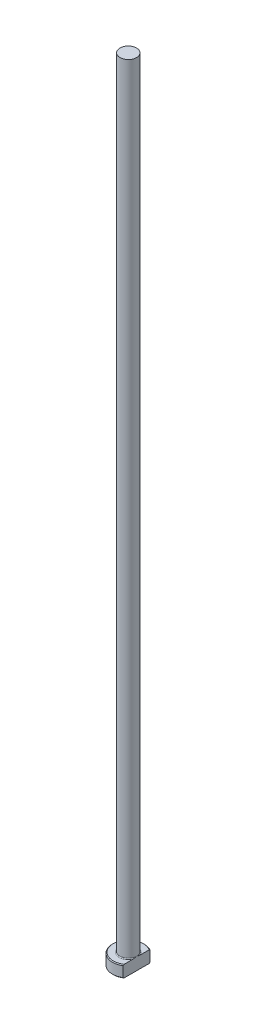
ISO-10303-21;
HEADER;
FILE_DESCRIPTION(('STEP AP214'),'2;1');
FILE_NAME('part.step','',(''),(''),'','','');
FILE_SCHEMA(('AUTOMOTIVE_DESIGN { 1 0 10303 214 1 1 1 1 }'));
ENDSEC;
DATA;
#1=APPLICATION_CONTEXT('core data for automotive mechanical design processes');
#2=APPLICATION_PROTOCOL_DEFINITION('international standard','automotive_design',2000,#1);
#3=PRODUCT_CONTEXT('',#1,'mechanical');
#4=PRODUCT('Part','Part','',(#3));
#5=PRODUCT_RELATED_PRODUCT_CATEGORY('part','',(#4));
#6=PRODUCT_DEFINITION_FORMATION('','',#4);
#7=PRODUCT_DEFINITION_CONTEXT('part definition',#1,'design');
#8=PRODUCT_DEFINITION('design','',#6,#7);
#9=PRODUCT_DEFINITION_SHAPE('','',#8);
#10=(LENGTH_UNIT() NAMED_UNIT(*) SI_UNIT(.MILLI.,.METRE.));
#11=(NAMED_UNIT(*) PLANE_ANGLE_UNIT() SI_UNIT($,.RADIAN.));
#12=(NAMED_UNIT(*) SI_UNIT($,.STERADIAN.) SOLID_ANGLE_UNIT());
#13=UNCERTAINTY_MEASURE_WITH_UNIT(LENGTH_MEASURE(1.E-05),#10,'distance_accuracy_value','');
#14=(GEOMETRIC_REPRESENTATION_CONTEXT(3) GLOBAL_UNCERTAINTY_ASSIGNED_CONTEXT((#13)) GLOBAL_UNIT_ASSIGNED_CONTEXT((#10,
#11,#12)) REPRESENTATION_CONTEXT('',''));
#15=CARTESIAN_POINT('',(0.,0.,0.));
#16=DIRECTION('',(0.,0.,1.));
#17=DIRECTION('',(1.,0.,0.));
#18=AXIS2_PLACEMENT_3D('',#15,#16,#17);
#19=CARTESIAN_POINT('',(0.,0.,0.));
#20=DIRECTION('',(0.,-1.,0.));
#21=DIRECTION('',(0.,0.,-1.));
#22=AXIS2_PLACEMENT_3D('',#19,#20,#21);
#23=PLANE('',#22);
#24=CARTESIAN_POINT('',(0.,0.,0.));
#25=DIRECTION('',(0.,-1.,0.));
#26=DIRECTION('',(0.,0.,-1.));
#27=AXIS2_PLACEMENT_3D('',#24,#25,#26);
#28=CIRCLE('',#27,3.79999999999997);
#29=CARTESIAN_POINT('',(2.09999999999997,0.,3.16701752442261));
#30=VERTEX_POINT('',#29);
#31=CARTESIAN_POINT('',(2.09999999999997,0.,-3.16701752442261));
#32=VERTEX_POINT('',#31);
#33=EDGE_CURVE('E98',#30,#32,#28,.T.);
#34=ORIENTED_EDGE('',*,*,#33,.T.);
#35=DIRECTION('',(0.,0.,1.));
#36=VECTOR('',#35,1.);
#37=CARTESIAN_POINT('',(2.09999999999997,0.,-3.40440890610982));
#38=LINE('',#37,#36);
#39=EDGE_CURVE('E83',#32,#30,#38,.T.);
#40=ORIENTED_EDGE('',*,*,#39,.T.);
#41=EDGE_LOOP('',(#34,#40));
#42=FACE_BOUND('',#41,.T.);
#43=ADVANCED_FACE('F32',(#42),#23,.T.);
#44=CARTESIAN_POINT('',(0.,259.958771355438,0.));
#45=DIRECTION('',(0.,1.,0.));
#46=DIRECTION('',(0.,0.,1.));
#47=AXIS2_PLACEMENT_3D('',#44,#45,#46);
#48=CYLINDRICAL_SURFACE('',#47,3.99999999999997);
#49=CARTESIAN_POINT('',(0.,2.80000000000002,0.));
#50=DIRECTION('',(0.,1.,0.));
#51=DIRECTION('',(0.,0.,1.));
#52=AXIS2_PLACEMENT_3D('',#49,#50,#51);
#53=CIRCLE('',#52,3.99999999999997);
#54=CARTESIAN_POINT('',(2.09999999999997,2.80000000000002,3.40440890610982));
#55=VERTEX_POINT('',#54);
#56=CARTESIAN_POINT('',(2.09999999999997,2.80000000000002,-3.40440890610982));
#57=VERTEX_POINT('',#56);
#58=EDGE_CURVE('E104',#55,#57,#53,.F.);
#59=ORIENTED_EDGE('',*,*,#58,.T.);
#60=DIRECTION('',(0.,-1.,0.));
#61=VECTOR('',#60,1.);
#62=CARTESIAN_POINT('',(2.09999999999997,200.,-3.40440890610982));
#63=LINE('',#62,#61);
#64=CARTESIAN_POINT('',(2.09999999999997,0.199999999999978,-3.40440890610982));
#65=VERTEX_POINT('',#64);
#66=EDGE_CURVE('E183',#57,#65,#63,.T.);
#67=ORIENTED_EDGE('',*,*,#66,.T.);
#68=CARTESIAN_POINT('',(0.,0.199999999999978,0.));
#69=DIRECTION('',(0.,-1.,0.));
#70=DIRECTION('',(0.,0.,-1.));
#71=AXIS2_PLACEMENT_3D('',#68,#69,#70);
#72=CIRCLE('',#71,3.99999999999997);
#73=CARTESIAN_POINT('',(2.09999999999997,0.199999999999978,3.40440890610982));
#74=VERTEX_POINT('',#73);
#75=EDGE_CURVE('E100',#65,#74,#72,.F.);
#76=ORIENTED_EDGE('',*,*,#75,.T.);
#77=DIRECTION('',(0.,-1.,0.));
#78=VECTOR('',#77,1.);
#79=CARTESIAN_POINT('',(2.09999999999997,200.,3.40440890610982));
#80=LINE('',#79,#78);
#81=EDGE_CURVE('E93',#55,#74,#80,.T.);
#82=ORIENTED_EDGE('',*,*,#81,.F.);
#83=EDGE_LOOP('',(#59,#67,#76,#82));
#84=FACE_BOUND('',#83,.T.);
#85=ADVANCED_FACE('F158',(#84),#48,.T.);
#86=CARTESIAN_POINT('',(-3.99999999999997,3.,0.));
#87=DIRECTION('',(0.,1.,0.));
#88=DIRECTION('',(0.,0.,1.));
#89=AXIS2_PLACEMENT_3D('',#86,#87,#88);
#90=PLANE('',#89);
#91=CARTESIAN_POINT('',(0.,3.,0.));
#92=DIRECTION('',(0.,1.,0.));
#93=DIRECTION('',(0.,0.,1.));
#94=AXIS2_PLACEMENT_3D('',#91,#92,#93);
#95=CIRCLE('',#94,3.80000000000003);
#96=CARTESIAN_POINT('',(2.09999999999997,3.,-3.16701752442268));
#97=VERTEX_POINT('',#96);
#98=CARTESIAN_POINT('',(2.09999999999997,3.,3.16701752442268));
#99=VERTEX_POINT('',#98);
#100=EDGE_CURVE('E178',#97,#99,#95,.T.);
#101=ORIENTED_EDGE('',*,*,#100,.T.);
#102=DIRECTION('',(0.,0.,-1.));
#103=VECTOR('',#102,1.);
#104=CARTESIAN_POINT('',(2.09999999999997,3.,0.));
#105=LINE('',#104,#103);
#106=CARTESIAN_POINT('',(2.09999999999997,2.99999999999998,0.938083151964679));
#107=VERTEX_POINT('',#106);
#108=EDGE_CURVE('E57',#99,#107,#105,.T.);
#109=ORIENTED_EDGE('',*,*,#108,.T.);
#110=CARTESIAN_POINT('',(0.,3.,0.));
#111=DIRECTION('',(0.,1.,0.));
#112=DIRECTION('',(0.,0.,1.));
#113=AXIS2_PLACEMENT_3D('',#110,#111,#112);
#114=CIRCLE('',#113,2.29999999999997);
#115=CARTESIAN_POINT('',(2.09999999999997,2.99999999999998,-0.938083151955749));
#116=VERTEX_POINT('',#115);
#117=EDGE_CURVE('E107',#107,#116,#114,.F.);
#118=ORIENTED_EDGE('',*,*,#117,.T.);
#119=EDGE_CURVE('E136',#116,#97,#105,.T.);
#120=ORIENTED_EDGE('',*,*,#119,.T.);
#121=EDGE_LOOP('',(#101,#109,#118,#120));
#122=FACE_BOUND('',#121,.T.);
#123=ADVANCED_FACE('F147',(#122),#90,.T.);
#124=CARTESIAN_POINT('',(0.,3.,0.));
#125=DIRECTION('',(0.,-1.,0.));
#126=DIRECTION('',(0.,0.,-1.));
#127=AXIS2_PLACEMENT_3D('',#124,#125,#126);
#128=CONICAL_SURFACE('',#127,3.80000000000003,0.785398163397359);
#129=ORIENTED_EDGE('',*,*,#58,.F.);
#130=CARTESIAN_POINT('',(2.09999999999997,-0.980423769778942,7.49166163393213));
#131=CARTESIAN_POINT('',(2.09999999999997,-0.83147426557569,7.33696373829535));
#132=CARTESIAN_POINT('',(2.09999999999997,-0.682692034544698,7.18210431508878));
#133=CARTESIAN_POINT('',(2.09999999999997,-0.385548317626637,6.8719796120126));
#134=CARTESIAN_POINT('',(2.09999999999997,-0.237186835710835,6.71671432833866));
#135=CARTESIAN_POINT('',(2.09999999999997,0.0590779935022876,6.40564381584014));
#136=CARTESIAN_POINT('',(2.09999999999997,0.206981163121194,6.24983841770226));
#137=CARTESIAN_POINT('',(2.09999999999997,0.502154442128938,5.9376299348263));
#138=CARTESIAN_POINT('',(2.09999999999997,0.649424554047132,5.78122685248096));
#139=CARTESIAN_POINT('',(2.09999999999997,0.94077633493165,5.47022973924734));
#140=CARTESIAN_POINT('',(2.09999999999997,1.08487085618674,5.31564775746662));
#141=CARTESIAN_POINT('',(2.09999999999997,1.372076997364,5.00557364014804));
#142=CARTESIAN_POINT('',(2.09999999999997,1.51518862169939,4.85008150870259));
#143=CARTESIAN_POINT('',(2.09999999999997,1.80010839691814,4.53794892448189));
#144=CARTESIAN_POINT('',(2.09999999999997,1.9419167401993,4.38130864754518));
#145=CARTESIAN_POINT('',(2.09999999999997,2.22381768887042,4.06649383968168));
#146=CARTESIAN_POINT('',(2.09999999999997,2.36391033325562,3.90831934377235));
#147=CARTESIAN_POINT('',(2.09999999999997,2.60581733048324,3.63104485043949));
#148=CARTESIAN_POINT('',(2.09999999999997,2.70816653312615,3.51241214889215));
#149=CARTESIAN_POINT('',(2.09999999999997,2.9111669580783,3.27367935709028));
#150=CARTESIAN_POINT('',(2.09999999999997,3.01181801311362,3.15357912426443));
#151=CARTESIAN_POINT('',(2.09999999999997,3.21179811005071,2.9103337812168));
#152=CARTESIAN_POINT('',(2.09999999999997,3.31110514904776,2.78717050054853));
#153=CARTESIAN_POINT('',(2.09999999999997,3.50648239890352,2.53834531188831));
#154=CARTESIAN_POINT('',(2.09999999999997,3.60255343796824,2.41268405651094));
#155=CARTESIAN_POINT('',(2.09999999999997,3.79142541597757,2.15619995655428));
#156=CARTESIAN_POINT('',(2.09999999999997,3.88416307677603,2.0253298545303));
#157=CARTESIAN_POINT('',(2.09999999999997,4.01801013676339,1.82534891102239));
#158=CARTESIAN_POINT('',(2.09999999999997,4.06178099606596,1.75802258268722));
#159=CARTESIAN_POINT('',(2.09999999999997,4.14708263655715,1.62197021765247));
#160=CARTESIAN_POINT('',(2.09999999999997,4.18861364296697,1.55324432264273));
#161=CARTESIAN_POINT('',(2.09999999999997,4.26843053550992,1.41491925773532));
#162=CARTESIAN_POINT('',(2.09999999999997,4.30674712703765,1.34533804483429));
#163=CARTESIAN_POINT('',(2.09999999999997,4.3798981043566,1.20437862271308));
#164=CARTESIAN_POINT('',(2.09999999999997,4.41473181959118,1.13300007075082));
#165=CARTESIAN_POINT('',(2.09999999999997,4.51246602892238,0.916193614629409));
#166=CARTESIAN_POINT('',(2.09999999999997,4.56890635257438,0.767589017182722));
#167=CARTESIAN_POINT('',(2.09999999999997,4.63146309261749,0.545044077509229));
#168=CARTESIAN_POINT('',(2.09999999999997,4.64829911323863,0.474096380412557));
#169=CARTESIAN_POINT('',(2.09999999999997,4.67524959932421,0.330910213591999));
#170=CARTESIAN_POINT('',(2.09999999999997,4.685364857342,0.258671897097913));
#171=CARTESIAN_POINT('',(2.09999999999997,4.69814808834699,0.113837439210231));
#172=CARTESIAN_POINT('',(2.09999999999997,4.70084750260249,0.0412441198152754));
#173=CARTESIAN_POINT('',(2.09999999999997,4.69868618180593,-0.103832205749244));
#174=CARTESIAN_POINT('',(2.09999999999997,4.69382503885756,-0.176315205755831));
#175=CARTESIAN_POINT('',(2.09999999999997,4.67696192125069,-0.319913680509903));
#176=CARTESIAN_POINT('',(2.09999999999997,4.66501009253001,-0.391035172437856));
#177=CARTESIAN_POINT('',(2.09999999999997,4.63477414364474,-0.531925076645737));
#178=CARTESIAN_POINT('',(2.09999999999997,4.61648741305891,-0.601692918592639));
#179=CARTESIAN_POINT('',(2.09999999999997,4.57440952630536,-0.740018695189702));
#180=CARTESIAN_POINT('',(2.09999999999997,4.5505834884,-0.808565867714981));
#181=CARTESIAN_POINT('',(2.09999999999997,4.49846635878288,-0.94390305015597));
#182=CARTESIAN_POINT('',(2.09999999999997,4.47017609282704,-1.01069338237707));
#183=CARTESIAN_POINT('',(2.09999999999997,4.38350646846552,-1.20069593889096));
#184=CARTESIAN_POINT('',(2.09999999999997,4.32056256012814,-1.32181878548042));
#185=CARTESIAN_POINT('',(2.09999999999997,4.1862118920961,-1.55931752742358));
#186=CARTESIAN_POINT('',(2.09999999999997,4.1147953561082,-1.67568772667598));
#187=CARTESIAN_POINT('',(2.09999999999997,3.96595132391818,-1.90511626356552));
#188=CARTESIAN_POINT('',(2.09999999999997,3.88850194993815,-2.01816028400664));
#189=CARTESIAN_POINT('',(2.09999999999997,3.72960863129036,-2.24129989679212));
#190=CARTESIAN_POINT('',(2.09999999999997,3.64816653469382,-2.3513968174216));
#191=CARTESIAN_POINT('',(2.09999999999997,3.48133411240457,-2.57073305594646));
#192=CARTESIAN_POINT('',(2.09999999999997,3.39590709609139,-2.67994433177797));
#193=CARTESIAN_POINT('',(2.09999999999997,3.2228375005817,-2.89660720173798));
#194=CARTESIAN_POINT('',(2.09999999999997,3.1351947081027,-3.00405862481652));
#195=CARTESIAN_POINT('',(2.09999999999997,2.95843815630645,-3.21731964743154));
#196=CARTESIAN_POINT('',(2.09999999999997,2.86932829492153,-3.32313248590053));
#197=CARTESIAN_POINT('',(2.09999999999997,2.68980874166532,-3.53365081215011));
#198=CARTESIAN_POINT('',(2.09999999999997,2.59939902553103,-3.6383562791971));
#199=CARTESIAN_POINT('',(2.09999999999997,2.36547490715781,-3.90659393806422));
#200=CARTESIAN_POINT('',(2.09999999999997,2.2212060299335,-4.06946765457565));
#201=CARTESIAN_POINT('',(2.09999999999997,1.93085962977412,-4.39359699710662));
#202=CARTESIAN_POINT('',(2.09999999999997,1.78478206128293,-4.55485258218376));
#203=CARTESIAN_POINT('',(2.09999999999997,1.49115582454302,-4.87627982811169));
#204=CARTESIAN_POINT('',(2.09999999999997,1.3436059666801,-5.03645040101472));
#205=CARTESIAN_POINT('',(2.09999999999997,1.04748117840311,-5.35584132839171));
#206=CARTESIAN_POINT('',(2.09999999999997,0.898906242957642,-5.51506167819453));
#207=CARTESIAN_POINT('',(2.09999999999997,0.463656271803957,-5.9791777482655));
#208=CARTESIAN_POINT('',(2.09999999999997,0.175917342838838,-6.28307552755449));
#209=CARTESIAN_POINT('',(2.09999999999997,-0.256953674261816,-6.73740739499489));
#210=CARTESIAN_POINT('',(2.09999999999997,-0.40137728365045,-6.888518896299));
#211=CARTESIAN_POINT('',(2.09999999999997,-0.690621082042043,-7.1903594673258));
#212=CARTESIAN_POINT('',(2.09999999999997,-0.835441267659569,-7.34108854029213));
#213=CARTESIAN_POINT('',(2.09999999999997,-0.980423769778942,-7.49166163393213));
#214=B_SPLINE_CURVE_WITH_KNOTS('',3,(#130,#131,#132,#133,#134,#135,#136,#137,#138,#139,#140,
#141,#142,#143,#144,#145,#146,#147,#148,#149,#150,#151,#152,#153,#154,#155,#156,#157,#158,#159,
#160,#161,#162,#163,#164,#165,#166,#167,#168,#169,#170,#171,#172,#173,#174,#175,#176,#177,#178,
#179,#180,#181,#182,#183,#184,#185,#186,#187,#188,#189,#190,#191,#192,#193,#194,#195,#196,#197,
#198,#199,#200,#201,#202,#203,#204,#205,#206,#207,#208,#209,#210,#211,#212,#213),.UNSPECIFIED.,
.F.,.F.,(4,2,2,2,2,2,2,2,2,2,2,2,2,2,2,2,2,2,2,2,2,2,2,2,2,2,2,2,2,2,2,2,2,2,2,2,2,2,2,2,2,4),
(0.,0.644249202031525,1.28850446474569,1.93298425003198,2.57746145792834,3.21143723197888,
3.84541015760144,4.47928793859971,5.1131512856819,5.58318355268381,6.05326185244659,
6.52785804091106,7.00233182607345,7.48334172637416,7.72421875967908,7.96507152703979,
8.20327136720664,8.44151697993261,8.91624038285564,9.13473354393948,9.35320093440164,
9.57074063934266,9.78829208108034,10.0043230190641,10.2204430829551,10.4379628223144,
10.6554423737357,11.0643686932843,11.4737715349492,11.8847351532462,12.2955103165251,
12.7114337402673,13.1273973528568,13.5423929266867,13.9573962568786,14.6101174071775,
15.2628550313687,15.9161714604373,16.5694910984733,17.8249945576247,18.4520794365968,
19.0791589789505),.UNSPECIFIED.);
#215=EDGE_CURVE('E135',#55,#99,#214,.T.);
#216=ORIENTED_EDGE('',*,*,#215,.T.);
#217=ORIENTED_EDGE('',*,*,#100,.F.);
#218=EDGE_CURVE('E127',#97,#57,#214,.T.);
#219=ORIENTED_EDGE('',*,*,#218,.T.);
#220=EDGE_LOOP('',(#129,#216,#217,#219));
#221=FACE_BOUND('',#220,.T.);
#222=ADVANCED_FACE('F143',(#221),#128,.T.);
#223=CARTESIAN_POINT('',(0.,0.199999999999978,0.));
#224=DIRECTION('',(0.,1.,0.));
#225=DIRECTION('',(0.,0.,1.));
#226=AXIS2_PLACEMENT_3D('',#223,#224,#225);
#227=CONICAL_SURFACE('',#226,3.99999999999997,0.785398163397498);
#228=ORIENTED_EDGE('',*,*,#75,.F.);
#229=CARTESIAN_POINT('',(2.09999999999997,3.98042376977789,-7.49166163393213));
#230=CARTESIAN_POINT('',(2.09999999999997,3.8314742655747,-7.33696373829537));
#231=CARTESIAN_POINT('',(2.09999999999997,3.68269203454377,-7.18210431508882));
#232=CARTESIAN_POINT('',(2.09999999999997,3.38554831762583,-6.87197961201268));
#233=CARTESIAN_POINT('',(2.09999999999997,3.23718683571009,-6.71671432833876));
#234=CARTESIAN_POINT('',(2.09999999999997,2.94092200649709,-6.40564381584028));
#235=CARTESIAN_POINT('',(2.09999999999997,2.79301883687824,-6.24983841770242));
#236=CARTESIAN_POINT('',(2.09999999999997,2.49784555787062,-5.9376299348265));
#237=CARTESIAN_POINT('',(2.09999999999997,2.35057544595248,-5.78122685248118));
#238=CARTESIAN_POINT('',(2.09999999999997,2.05922366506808,-5.4702297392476));
#239=CARTESIAN_POINT('',(2.09999999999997,1.91512914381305,-5.3156477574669));
#240=CARTESIAN_POINT('',(2.09999999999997,1.6279230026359,-5.00557364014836));
#241=CARTESIAN_POINT('',(2.09999999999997,1.48481137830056,-4.85008150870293));
#242=CARTESIAN_POINT('',(2.09999999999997,1.19989160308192,-4.53794892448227));
#243=CARTESIAN_POINT('',(2.09999999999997,1.05808325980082,-4.38130864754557));
#244=CARTESIAN_POINT('',(2.09999999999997,0.776182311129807,-4.06649383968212));
#245=CARTESIAN_POINT('',(2.09999999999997,0.636089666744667,-3.9083193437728));
#246=CARTESIAN_POINT('',(2.09999999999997,0.394182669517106,-3.63104485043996));
#247=CARTESIAN_POINT('',(2.09999999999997,0.291833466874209,-3.51241214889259));
#248=CARTESIAN_POINT('',(2.09999999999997,0.0888330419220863,-3.2736793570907));
#249=CARTESIAN_POINT('',(2.09999999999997,-0.0118180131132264,-3.15357912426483));
#250=CARTESIAN_POINT('',(2.09999999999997,-0.211798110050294,-2.91033378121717));
#251=CARTESIAN_POINT('',(2.09999999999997,-0.311105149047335,-2.78717050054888));
#252=CARTESIAN_POINT('',(2.09999999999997,-0.506482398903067,-2.53834531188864));
#253=CARTESIAN_POINT('',(2.09999999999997,-0.602553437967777,-2.41268405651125));
#254=CARTESIAN_POINT('',(2.09999999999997,-0.791425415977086,-2.15619995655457));
#255=CARTESIAN_POINT('',(2.09999999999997,-0.884163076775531,-2.02532985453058));
#256=CARTESIAN_POINT('',(2.09999999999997,-1.01801013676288,-1.82534891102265));
#257=CARTESIAN_POINT('',(2.09999999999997,-1.06178099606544,-1.75802258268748));
#258=CARTESIAN_POINT('',(2.09999999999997,-1.14708263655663,-1.62197021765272));
#259=CARTESIAN_POINT('',(2.09999999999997,-1.18861364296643,-1.55324432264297));
#260=CARTESIAN_POINT('',(2.09999999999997,-1.26843053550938,-1.41491925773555));
#261=CARTESIAN_POINT('',(2.09999999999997,-1.3067471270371,-1.34533804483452));
#262=CARTESIAN_POINT('',(2.09999999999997,-1.37989810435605,-1.2043786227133));
#263=CARTESIAN_POINT('',(2.09999999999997,-1.41473181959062,-1.13300007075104));
#264=CARTESIAN_POINT('',(2.09999999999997,-1.51246602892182,-0.916193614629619));
#265=CARTESIAN_POINT('',(2.09999999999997,-1.56890635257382,-0.767589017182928));
#266=CARTESIAN_POINT('',(2.09999999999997,-1.63146309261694,-0.545044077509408));
#267=CARTESIAN_POINT('',(2.09999999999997,-1.64829911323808,-0.474096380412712));
#268=CARTESIAN_POINT('',(2.09999999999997,-1.67524959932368,-0.330910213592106));
#269=CARTESIAN_POINT('',(2.09999999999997,-1.68536485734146,-0.258671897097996));
#270=CARTESIAN_POINT('',(2.09999999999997,-1.69814808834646,-0.113837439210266));
#271=CARTESIAN_POINT('',(2.09999999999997,-1.70084750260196,-0.0412441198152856));
#272=CARTESIAN_POINT('',(2.09999999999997,-1.6986861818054,0.103832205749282));
#273=CARTESIAN_POINT('',(2.09999999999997,-1.69382503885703,0.176315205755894));
#274=CARTESIAN_POINT('',(2.09999999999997,-1.67696192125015,0.319913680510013));
#275=CARTESIAN_POINT('',(2.09999999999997,-1.66501009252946,0.391035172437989));
#276=CARTESIAN_POINT('',(2.09999999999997,-1.63477414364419,0.531925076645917));
#277=CARTESIAN_POINT('',(2.09999999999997,-1.61648741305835,0.601692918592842));
#278=CARTESIAN_POINT('',(2.09999999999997,-1.57440952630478,0.740018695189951));
#279=CARTESIAN_POINT('',(2.09999999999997,-1.55058348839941,0.808565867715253));
#280=CARTESIAN_POINT('',(2.09999999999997,-1.49846635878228,0.943903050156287));
#281=CARTESIAN_POINT('',(2.09999999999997,-1.47017609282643,1.01069338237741));
#282=CARTESIAN_POINT('',(2.09999999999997,-1.38350646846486,1.20069593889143));
#283=CARTESIAN_POINT('',(2.09999999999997,-1.32056256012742,1.32181878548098));
#284=CARTESIAN_POINT('',(2.09999999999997,-1.18621189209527,1.55931752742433));
#285=CARTESIAN_POINT('',(2.09999999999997,-1.1147953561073,1.67568772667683));
#286=CARTESIAN_POINT('',(2.09999999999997,-0.965951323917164,1.90511626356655));
#287=CARTESIAN_POINT('',(2.09999999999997,-0.888501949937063,2.01816028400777));
#288=CARTESIAN_POINT('',(2.09999999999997,-0.729608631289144,2.24129989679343));
#289=CARTESIAN_POINT('',(2.09999999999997,-0.648166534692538,2.351396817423));
#290=CARTESIAN_POINT('',(2.09999999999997,-0.48133411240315,2.57073305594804));
#291=CARTESIAN_POINT('',(2.09999999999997,-0.395907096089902,2.67994433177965));
#292=CARTESIAN_POINT('',(2.09999999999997,-0.222837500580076,2.89660720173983));
#293=CARTESIAN_POINT('',(2.09999999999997,-0.135194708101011,3.00405862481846));
#294=CARTESIAN_POINT('',(2.09999999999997,0.0415618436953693,3.21731964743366));
#295=CARTESIAN_POINT('',(2.09999999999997,0.130671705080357,3.32313248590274));
#296=CARTESIAN_POINT('',(2.09999999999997,0.310191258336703,3.5336508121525));
#297=CARTESIAN_POINT('',(2.09999999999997,0.400600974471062,3.63835627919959));
#298=CARTESIAN_POINT('',(2.09999999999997,0.634525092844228,3.90659393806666));
#299=CARTESIAN_POINT('',(2.09999999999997,0.778793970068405,4.06946765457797));
#300=CARTESIAN_POINT('',(2.09999999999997,1.06914037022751,4.39359699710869));
#301=CARTESIAN_POINT('',(2.09999999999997,1.21521793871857,4.55485258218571));
#302=CARTESIAN_POINT('',(2.09999999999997,1.50884417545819,4.87627982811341));
#303=CARTESIAN_POINT('',(2.09999999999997,1.65639403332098,5.03645040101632));
#304=CARTESIAN_POINT('',(2.09999999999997,1.95251882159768,5.35584132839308));
#305=CARTESIAN_POINT('',(2.09999999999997,2.101093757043,5.51506167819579));
#306=CARTESIAN_POINT('',(2.09999999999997,2.53634372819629,5.97917774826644));
#307=CARTESIAN_POINT('',(2.09999999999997,2.82408265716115,6.28307552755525));
#308=CARTESIAN_POINT('',(2.09999999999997,3.25695367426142,6.73740739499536));
#309=CARTESIAN_POINT('',(2.09999999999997,3.40137728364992,6.88851889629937));
#310=CARTESIAN_POINT('',(2.09999999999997,3.69062108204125,7.19035946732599));
#311=CARTESIAN_POINT('',(2.09999999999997,3.83544126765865,7.34108854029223));
#312=CARTESIAN_POINT('',(2.09999999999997,3.98042376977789,7.49166163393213));
#313=B_SPLINE_CURVE_WITH_KNOTS('',3,(#229,#230,#231,#232,#233,#234,#235,#236,#237,#238,#239,
#240,#241,#242,#243,#244,#245,#246,#247,#248,#249,#250,#251,#252,#253,#254,#255,#256,#257,#258,
#259,#260,#261,#262,#263,#264,#265,#266,#267,#268,#269,#270,#271,#272,#273,#274,#275,#276,#277,
#278,#279,#280,#281,#282,#283,#284,#285,#286,#287,#288,#289,#290,#291,#292,#293,#294,#295,#296,
#297,#298,#299,#300,#301,#302,#303,#304,#305,#306,#307,#308,#309,#310,#311,#312),.UNSPECIFIED.,
.F.,.F.,(4,2,2,2,2,2,2,2,2,2,2,2,2,2,2,2,2,2,2,2,2,2,2,2,2,2,2,2,2,2,2,2,2,2,2,2,2,2,2,2,2,4),
(0.,0.644249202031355,1.28850446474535,1.93298425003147,2.57746145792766,3.21143723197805,
3.84541015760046,4.47928793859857,5.1131512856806,5.58318355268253,6.05326185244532,
6.52785804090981,7.00233182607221,7.48334172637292,7.72421875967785,7.96507152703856,
8.20327136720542,8.44151697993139,8.91624038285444,9.13473354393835,9.35320093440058,
9.57074063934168,9.78829208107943,10.0043230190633,10.2204430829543,10.4379628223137,
10.6554423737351,11.064368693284,11.4737715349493,11.8847351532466,12.2955103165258,
12.7114337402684,13.1273973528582,13.5423929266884,13.9573962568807,14.610117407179,
15.2628550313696,15.9161714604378,16.5694910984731,17.8249945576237,18.4520794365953,
19.0791589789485),.UNSPECIFIED.);
#314=EDGE_CURVE('E86',#65,#32,#313,.T.);
#315=ORIENTED_EDGE('',*,*,#314,.T.);
#316=ORIENTED_EDGE('',*,*,#33,.F.);
#317=EDGE_CURVE('E89',#30,#74,#313,.T.);
#318=ORIENTED_EDGE('',*,*,#317,.T.);
#319=EDGE_LOOP('',(#228,#315,#316,#318));
#320=FACE_BOUND('',#319,.T.);
#321=ADVANCED_FACE('F97',(#320),#227,.T.);
#322=CARTESIAN_POINT('',(0.,3.19999999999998,0.));
#323=DIRECTION('',(0.,1.,0.));
#324=DIRECTION('',(0.,0.,1.));
#325=AXIS2_PLACEMENT_3D('',#322,#323,#324);
#326=TOROIDAL_SURFACE('',#325,2.29999999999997,0.2);
#327=CARTESIAN_POINT('',(2.09999999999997,3.19999999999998,0.));
#328=CARTESIAN_POINT('',(2.09999999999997,3.20000050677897,1.12871213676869E-10));
#329=CARTESIAN_POINT('',(2.09999999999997,3.20000101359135,-1.5160230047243E-07));
#330=CARTESIAN_POINT('',(2.09999999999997,3.20000197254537,-5.98005719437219E-07));
#331=CARTESIAN_POINT('',(2.09999999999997,3.2000024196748,-9.0062574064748E-07));
#332=CARTESIAN_POINT('',(2.09999999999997,3.20000332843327,-1.62318945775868E-06));
#333=CARTESIAN_POINT('',(2.09999999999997,3.20000378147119,-2.05406588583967E-06));
#334=CARTESIAN_POINT('',(2.09999999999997,3.20000461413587,-2.96308561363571E-06));
#335=CARTESIAN_POINT('',(2.09999999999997,3.20000499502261,-3.4401425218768E-06));
#336=CARTESIAN_POINT('',(2.09999999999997,3.20000634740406,-5.22586037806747E-06));
#337=CARTESIAN_POINT('',(2.09999999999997,3.20000724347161,-6.59340897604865E-06));
#338=CARTESIAN_POINT('',(2.09999999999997,3.20000877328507,-9.35203600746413E-06));
#339=CARTESIAN_POINT('',(2.09999999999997,3.20000941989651,-1.07363396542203E-05));
#340=CARTESIAN_POINT('',(2.09999999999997,3.20001201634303,-1.6407290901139E-05));
#341=CARTESIAN_POINT('',(2.09999999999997,3.20001387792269,-2.07387533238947E-05));
#342=CARTESIAN_POINT('',(2.09999999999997,3.2000167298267,-2.90585196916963E-05));
#343=CARTESIAN_POINT('',(2.09999999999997,3.20001780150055,-3.30191375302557E-05));
#344=CARTESIAN_POINT('',(2.09999999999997,3.20002541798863,-6.18759983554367E-05));
#345=CARTESIAN_POINT('',(2.09999999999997,3.20003100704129,-8.69774695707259E-05));
#346=CARTESIAN_POINT('',(2.09999999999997,3.20005545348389,-0.000185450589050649));
#347=CARTESIAN_POINT('',(2.09999999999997,3.20007895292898,-0.000257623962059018));
#348=CARTESIAN_POINT('',(2.09999999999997,3.20016974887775,-0.000541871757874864));
#349=CARTESIAN_POINT('',(2.09999999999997,3.20023388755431,-0.000754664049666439));
#350=CARTESIAN_POINT('',(2.09999999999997,3.20048929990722,-0.00159500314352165));
#351=CARTESIAN_POINT('',(2.09999999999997,3.2006844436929,-0.00222165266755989));
#352=CARTESIAN_POINT('',(2.09999999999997,3.2014903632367,-0.00481735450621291));
#353=CARTESIAN_POINT('',(2.09999999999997,3.2020963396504,-0.0067875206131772));
#354=CARTESIAN_POINT('',(2.09999999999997,3.20811857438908,-0.0263575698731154));
#355=CARTESIAN_POINT('',(2.09999999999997,3.21355673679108,-0.0439525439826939));
#356=CARTESIAN_POINT('',(2.09999999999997,3.22417769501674,-0.078471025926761));
#357=CARTESIAN_POINT('',(2.09999999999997,3.22936219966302,-0.0953940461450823));
#358=CARTESIAN_POINT('',(2.09999999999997,3.24031741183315,-0.131344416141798));
#359=CARTESIAN_POINT('',(2.09999999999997,3.24608153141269,-0.150373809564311));
#360=CARTESIAN_POINT('',(2.09999999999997,3.25756719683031,-0.188666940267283));
#361=CARTESIAN_POINT('',(2.09999999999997,3.263287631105,-0.207931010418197));
#362=CARTESIAN_POINT('',(2.09999999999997,3.27708776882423,-0.255037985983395));
#363=CARTESIAN_POINT('',(2.09999999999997,3.2850908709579,-0.282903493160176));
#364=CARTESIAN_POINT('',(2.09999999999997,3.30049018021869,-0.33805925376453));
#365=CARTESIAN_POINT('',(2.09999999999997,3.30789650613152,-0.365346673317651));
#366=CARTESIAN_POINT('',(2.09999999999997,3.32422959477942,-0.427831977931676));
#367=CARTESIAN_POINT('',(2.09999999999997,3.33299018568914,-0.46307381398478));
#368=CARTESIAN_POINT('',(2.09999999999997,3.34944378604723,-0.534083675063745));
#369=CARTESIAN_POINT('',(2.09999999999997,3.35712842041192,-0.569853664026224));
#370=CARTESIAN_POINT('',(2.09999999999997,3.37150595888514,-0.644262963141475));
#371=CARTESIAN_POINT('',(2.09999999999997,3.37808822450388,-0.682924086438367));
#372=CARTESIAN_POINT('',(2.09999999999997,3.38900927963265,-0.760558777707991));
#373=CARTESIAN_POINT('',(2.09999999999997,3.39334901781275,-0.799532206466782));
#374=CARTESIAN_POINT('',(2.09999999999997,3.39885385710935,-0.874699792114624));
#375=CARTESIAN_POINT('',(2.09999999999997,3.40023755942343,-0.910877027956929));
#376=CARTESIAN_POINT('',(2.09999999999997,3.39969515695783,-0.983205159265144));
#377=CARTESIAN_POINT('',(2.09999999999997,3.39777304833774,-1.01935603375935));
#378=CARTESIAN_POINT('',(2.09999999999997,3.39020522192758,-1.08431292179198));
#379=CARTESIAN_POINT('',(2.09999999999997,3.38533825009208,-1.11320671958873));
#380=CARTESIAN_POINT('',(2.09999999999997,3.37160685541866,-1.1700898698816));
#381=CARTESIAN_POINT('',(2.09999999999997,3.36275087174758,-1.19808099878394));
#382=CARTESIAN_POINT('',(2.09999999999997,3.34648318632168,-1.23525714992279));
#383=CARTESIAN_POINT('',(2.09999999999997,3.34148711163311,-1.24549622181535));
#384=CARTESIAN_POINT('',(2.09999999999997,3.33045865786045,-1.26542566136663));
#385=CARTESIAN_POINT('',(2.09999999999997,3.32442526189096,-1.27511547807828));
#386=CARTESIAN_POINT('',(2.09999999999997,3.31108244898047,-1.29375285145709));
#387=CARTESIAN_POINT('',(2.09999999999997,3.30375956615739,-1.30269093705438));
#388=CARTESIAN_POINT('',(2.09999999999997,3.28770931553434,-1.31920846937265));
#389=CARTESIAN_POINT('',(2.09999999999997,3.27898657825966,-1.32679222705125));
#390=CARTESIAN_POINT('',(2.09999999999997,3.26379332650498,-1.33730272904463));
#391=CARTESIAN_POINT('',(2.09999999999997,3.25778099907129,-1.34088947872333));
#392=CARTESIAN_POINT('',(2.09999999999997,3.24526530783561,-1.34707853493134));
#393=CARTESIAN_POINT('',(2.09999999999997,3.23876236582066,-1.34968167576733));
#394=CARTESIAN_POINT('',(2.09999999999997,3.22533138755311,-1.35371298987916));
#395=CARTESIAN_POINT('',(2.09999999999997,3.21840009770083,-1.35513055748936));
#396=CARTESIAN_POINT('',(2.09999999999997,3.2043942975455,-1.35660326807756));
#397=CARTESIAN_POINT('',(2.09999999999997,3.19731988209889,-1.35665928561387));
#398=CARTESIAN_POINT('',(2.09999999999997,3.18410044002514,-1.35547833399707));
#399=CARTESIAN_POINT('',(2.09999999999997,3.17794157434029,-1.3543883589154));
#400=CARTESIAN_POINT('',(2.09999999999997,3.16588195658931,-1.35123020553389));
#401=CARTESIAN_POINT('',(2.09999999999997,3.15998132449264,-1.34916157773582));
#402=CARTESIAN_POINT('',(2.09999999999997,3.14673410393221,-1.34339681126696));
#403=CARTESIAN_POINT('',(2.09999999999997,3.13952216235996,-1.33939261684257));
#404=CARTESIAN_POINT('',(2.09999999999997,3.1258371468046,-1.33027651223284));
#405=CARTESIAN_POINT('',(2.09999999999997,3.11936569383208,-1.3251622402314));
#406=CARTESIAN_POINT('',(2.09999999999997,3.10400061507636,-1.31126465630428));
#407=CARTESIAN_POINT('',(2.09999999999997,3.09558831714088,-1.3019528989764));
#408=CARTESIAN_POINT('',(2.09999999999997,3.0802757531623,-1.28218529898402));
#409=CARTESIAN_POINT('',(2.09999999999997,3.07337755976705,-1.27172791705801));
#410=CARTESIAN_POINT('',(2.09999999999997,3.05595453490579,-1.24164701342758));
#411=CARTESIAN_POINT('',(2.09999999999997,3.0467992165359,-1.22123760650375));
#412=CARTESIAN_POINT('',(2.09999999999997,3.03140603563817,-1.17923303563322));
#413=CARTESIAN_POINT('',(2.09999999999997,3.02519350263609,-1.15762930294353));
#414=CARTESIAN_POINT('',(2.09999999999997,3.014897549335,-1.11311363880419));
#415=CARTESIAN_POINT('',(2.09999999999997,3.01089884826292,-1.09018261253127));
#416=CARTESIAN_POINT('',(2.09999999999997,3.00485282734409,-1.04403569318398));
#417=CARTESIAN_POINT('',(2.09999999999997,3.00280937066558,-1.02081932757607));
#418=CARTESIAN_POINT('',(2.09999999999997,2.99913236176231,-0.952629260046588));
#419=CARTESIAN_POINT('',(2.09999999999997,2.99965574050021,-0.907543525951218));
#420=CARTESIAN_POINT('',(2.09999999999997,3.00580977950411,-0.79983290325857));
#421=CARTESIAN_POINT('',(2.09999999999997,3.01338406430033,-0.737345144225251));
#422=CARTESIAN_POINT('',(2.09999999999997,3.03389167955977,-0.611758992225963));
#423=CARTESIAN_POINT('',(2.09999999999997,3.04695134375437,-0.548682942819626));
#424=CARTESIAN_POINT('',(2.09999999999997,3.07174522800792,-0.44346393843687));
#425=CARTESIAN_POINT('',(2.09999999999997,3.08256100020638,-0.401095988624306));
#426=CARTESIAN_POINT('',(2.09999999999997,3.10517491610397,-0.317118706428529));
#427=CARTESIAN_POINT('',(2.09999999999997,3.11696109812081,-0.275506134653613));
#428=CARTESIAN_POINT('',(2.09999999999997,3.13984946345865,-0.197106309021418));
#429=CARTESIAN_POINT('',(2.09999999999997,3.15088145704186,-0.160298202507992));
#430=CARTESIAN_POINT('',(2.09999999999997,3.17371469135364,-0.0852465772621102));
#431=CARTESIAN_POINT('',(2.09999999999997,3.18552885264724,-0.0470069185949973));
#432=CARTESIAN_POINT('',(2.09999999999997,3.1979046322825,-0.00678406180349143));
#433=CARTESIAN_POINT('',(2.09999999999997,3.19851173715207,-0.0048104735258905));
#434=CARTESIAN_POINT('',(2.09999999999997,3.19931792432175,-0.00221397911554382));
#435=CARTESIAN_POINT('',(2.09999999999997,3.19951224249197,-0.00158996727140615));
#436=CARTESIAN_POINT('',(2.09999999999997,3.19976664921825,-0.000752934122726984));
#437=CARTESIAN_POINT('',(2.09999999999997,3.1998305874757,-0.000540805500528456));
#438=CARTESIAN_POINT('',(2.09999999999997,3.19992113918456,-0.00025733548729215));
#439=CARTESIAN_POINT('',(2.09999999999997,3.19994460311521,-0.000185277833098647));
#440=CARTESIAN_POINT('',(2.09999999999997,3.19996901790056,-8.69395480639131E-05));
#441=CARTESIAN_POINT('',(2.09999999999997,3.1999746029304,-6.18551879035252E-05));
#442=CARTESIAN_POINT('',(2.09999999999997,3.19998221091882,-3.30155874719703E-05));
#443=CARTESIAN_POINT('',(2.09999999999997,3.19998328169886,-2.90560037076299E-05));
#444=CARTESIAN_POINT('',(2.09999999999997,3.19998613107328,-2.07382812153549E-05));
#445=CARTESIAN_POINT('',(2.09999999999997,3.19998799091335,-1.64077754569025E-05));
#446=CARTESIAN_POINT('',(2.09999999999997,3.19999058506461,-1.0737787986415E-05));
#447=CARTESIAN_POINT('',(2.09999999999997,3.19999123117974,-9.35356155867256E-06));
#448=CARTESIAN_POINT('',(2.09999999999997,3.19999275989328,-6.59500016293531E-06));
#449=CARTESIAN_POINT('',(2.09999999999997,3.19999365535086,-5.22743189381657E-06));
#450=CARTESIAN_POINT('',(2.09999999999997,3.19999500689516,-3.44158185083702E-06));
#451=CARTESIAN_POINT('',(2.09999999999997,3.19999538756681,-2.96446374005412E-06));
#452=CARTESIAN_POINT('',(2.09999999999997,3.19999621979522,-2.05528284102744E-06));
#453=CARTESIAN_POINT('',(2.09999999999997,3.1999966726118,-1.62430552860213E-06));
#454=CARTESIAN_POINT('',(2.09999999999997,3.19999758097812,-9.01501322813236E-07));
#455=CARTESIAN_POINT('',(2.09999999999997,3.19999802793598,-5.98749119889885E-07));
#456=CARTESIAN_POINT('',(2.09999999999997,3.19999898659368,-1.52018312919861E-07));
#457=CARTESIAN_POINT('',(2.09999999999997,3.19999949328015,-1.12858037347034E-10));
#458=CARTESIAN_POINT('',(2.09999999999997,3.19999999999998,0.));
#459=B_SPLINE_CURVE_WITH_KNOTS('',3,(#327,#328,#329,#330,#331,#332,#333,#334,#335,#336,#337,
#338,#339,#340,#341,#342,#343,#344,#345,#346,#347,#348,#349,#350,#351,#352,#353,#354,#355,#356,
#357,#358,#359,#360,#361,#362,#363,#364,#365,#366,#367,#368,#369,#370,#371,#372,#373,#374,#375,
#376,#377,#378,#379,#380,#381,#382,#383,#384,#385,#386,#387,#388,#389,#390,#391,#392,#393,#394,
#395,#396,#397,#398,#399,#400,#401,#402,#403,#404,#405,#406,#407,#408,#409,#410,#411,#412,#413,
#414,#415,#416,#417,#418,#419,#420,#421,#422,#423,#424,#425,#426,#427,#428,#429,#430,#431,#432,
#433,#434,#435,#436,#437,#438,#439,#440,#441,#442,#443,#444,#445,#446,#447,#448,#449,#450,#451,
#452,#453,#454,#455,#456,#457,#458),.UNSPECIFIED.,.T.,.F.,(4,2,2,2,2,2,2,2,2,2,2,2,2,2,2,2,2,2,
2,2,2,2,2,2,2,2,2,2,2,2,2,2,2,2,2,2,2,2,2,2,2,2,2,2,2,2,2,2,2,2,2,2,2,2,2,2,2,2,2,2,2,2,2,2,2,
4),(0.,1.52446483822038E-06,3.13917159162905E-06,5.00540711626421E-06,6.83522638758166E-06,
1.1719467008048E-05,1.62993936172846E-05,3.04103902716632E-05,4.27033722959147E-05,
0.000119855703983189,0.000347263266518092,0.00101430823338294,0.002982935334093,
0.00916710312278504,0.0644134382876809,0.117512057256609,0.17716136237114,0.237447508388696,
0.324420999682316,0.409241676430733,0.518170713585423,0.627905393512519,0.745509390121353,
0.863063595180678,0.971571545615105,1.07994842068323,1.1676881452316,1.25524311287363,
1.28937713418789,1.32354480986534,1.35809310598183,1.39252939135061,1.41346149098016,
1.43437579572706,1.45547524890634,1.47656114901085,1.49523795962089,1.51392335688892,
1.53853256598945,1.56319465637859,1.60062921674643,1.63811470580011,1.7048463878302,
1.77214245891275,1.84186170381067,1.91171841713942,2.04668000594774,2.23517885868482,
2.42828019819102,2.55944432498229,2.68918212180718,2.80445903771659,2.9245225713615,
2.93071753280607,2.93267787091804,2.93334283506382,2.93356987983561,2.93364697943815,
2.93365926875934,2.93367337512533,2.93367795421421,2.93368283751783,2.93368466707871,
2.9336865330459,2.93368814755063,2.93368967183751),.UNSPECIFIED.);
#460=CARTESIAN_POINT('',(2.09999999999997,3.19999999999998,0.));
#461=VERTEX_POINT('',#460);
#462=EDGE_CURVE('E11',#116,#461,#459,.T.);
#463=ORIENTED_EDGE('',*,*,#462,.F.);
#464=ORIENTED_EDGE('',*,*,#117,.F.);
#465=CARTESIAN_POINT('',(2.09999999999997,3.19999999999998,0.));
#466=CARTESIAN_POINT('',(2.09999999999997,3.19999949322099,-1.12871210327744E-10));
#467=CARTESIAN_POINT('',(2.09999999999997,3.19999898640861,1.51602300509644E-07));
#468=CARTESIAN_POINT('',(2.09999999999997,3.19999802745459,5.98005719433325E-07));
#469=CARTESIAN_POINT('',(2.09999999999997,3.19999758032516,9.00625740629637E-07));
#470=CARTESIAN_POINT('',(2.09999999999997,3.19999667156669,1.62318945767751E-06));
#471=CARTESIAN_POINT('',(2.09999999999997,3.19999621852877,2.05406588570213E-06));
#472=CARTESIAN_POINT('',(2.09999999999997,3.1999953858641,2.96308561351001E-06));
#473=CARTESIAN_POINT('',(2.09999999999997,3.19999500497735,3.4401425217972E-06));
#474=CARTESIAN_POINT('',(2.09999999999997,3.1999936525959,5.22586037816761E-06));
#475=CARTESIAN_POINT('',(2.09999999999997,3.19999275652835,6.5934089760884E-06));
#476=CARTESIAN_POINT('',(2.09999999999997,3.19999122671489,9.3520360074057E-06));
#477=CARTESIAN_POINT('',(2.09999999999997,3.19999058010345,1.0736339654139E-05));
#478=CARTESIAN_POINT('',(2.09999999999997,3.19998798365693,1.64072909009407E-05));
#479=CARTESIAN_POINT('',(2.09999999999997,3.19998612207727,2.07387533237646E-05));
#480=CARTESIAN_POINT('',(2.09999999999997,3.19998327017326,2.90585196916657E-05));
#481=CARTESIAN_POINT('',(2.09999999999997,3.19998219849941,3.30191375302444E-05));
#482=CARTESIAN_POINT('',(2.09999999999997,3.19997458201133,6.18759983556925E-05));
#483=CARTESIAN_POINT('',(2.09999999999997,3.19996899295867,8.69774695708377E-05));
#484=CARTESIAN_POINT('',(2.09999999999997,3.19994454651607,0.000185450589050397));
#485=CARTESIAN_POINT('',(2.09999999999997,3.19992104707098,0.000257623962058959));
#486=CARTESIAN_POINT('',(2.09999999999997,3.19983025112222,0.000541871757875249));
#487=CARTESIAN_POINT('',(2.09999999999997,3.19976611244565,0.000754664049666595));
#488=CARTESIAN_POINT('',(2.09999999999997,3.19951070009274,0.00159500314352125));
#489=CARTESIAN_POINT('',(2.09999999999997,3.19931555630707,0.00222165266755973));
#490=CARTESIAN_POINT('',(2.09999999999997,3.19850963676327,0.00481735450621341));
#491=CARTESIAN_POINT('',(2.09999999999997,3.19790366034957,0.00678752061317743));
#492=CARTESIAN_POINT('',(2.09999999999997,3.19188142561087,0.0263575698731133));
#493=CARTESIAN_POINT('',(2.09999999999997,3.18644326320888,0.0439525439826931));
#494=CARTESIAN_POINT('',(2.09999999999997,3.17582230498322,0.0784710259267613));
#495=CARTESIAN_POINT('',(2.09999999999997,3.17063780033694,0.0953940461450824));
#496=CARTESIAN_POINT('',(2.09999999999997,3.15968258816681,0.131344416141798));
#497=CARTESIAN_POINT('',(2.09999999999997,3.15391846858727,0.150373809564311));
#498=CARTESIAN_POINT('',(2.09999999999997,3.14243280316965,0.188666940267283));
#499=CARTESIAN_POINT('',(2.09999999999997,3.13671236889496,0.207931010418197));
#500=CARTESIAN_POINT('',(2.09999999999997,3.12291223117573,0.255037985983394));
#501=CARTESIAN_POINT('',(2.09999999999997,3.11490912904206,0.282903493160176));
#502=CARTESIAN_POINT('',(2.09999999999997,3.09950981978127,0.33805925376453));
#503=CARTESIAN_POINT('',(2.09999999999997,3.09210349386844,0.365346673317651));
#504=CARTESIAN_POINT('',(2.09999999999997,3.07577040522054,0.427831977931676));
#505=CARTESIAN_POINT('',(2.09999999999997,3.06700981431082,0.46307381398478));
#506=CARTESIAN_POINT('',(2.09999999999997,3.05055621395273,0.534083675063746));
#507=CARTESIAN_POINT('',(2.09999999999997,3.04287157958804,0.569853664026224));
#508=CARTESIAN_POINT('',(2.09999999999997,3.02849404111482,0.644262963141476));
#509=CARTESIAN_POINT('',(2.09999999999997,3.02191177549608,0.682924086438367));
#510=CARTESIAN_POINT('',(2.09999999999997,3.01099072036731,0.760558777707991));
#511=CARTESIAN_POINT('',(2.09999999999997,3.00665098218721,0.799532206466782));
#512=CARTESIAN_POINT('',(2.09999999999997,3.00114614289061,0.874699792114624));
#513=CARTESIAN_POINT('',(2.09999999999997,2.99976244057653,0.910877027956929));
#514=CARTESIAN_POINT('',(2.09999999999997,3.00030484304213,0.983205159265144));
#515=CARTESIAN_POINT('',(2.09999999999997,3.00222695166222,1.01935603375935));
#516=CARTESIAN_POINT('',(2.09999999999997,3.00979477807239,1.08431292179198));
#517=CARTESIAN_POINT('',(2.09999999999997,3.01466174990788,1.11320671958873));
#518=CARTESIAN_POINT('',(2.09999999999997,3.0283931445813,1.1700898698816));
#519=CARTESIAN_POINT('',(2.09999999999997,3.03724912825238,1.19808099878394));
#520=CARTESIAN_POINT('',(2.09999999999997,3.05351681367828,1.23525714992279));
#521=CARTESIAN_POINT('',(2.09999999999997,3.05851288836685,1.24549622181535));
#522=CARTESIAN_POINT('',(2.09999999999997,3.06954134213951,1.26542566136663));
#523=CARTESIAN_POINT('',(2.09999999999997,3.075574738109,1.27511547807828));
#524=CARTESIAN_POINT('',(2.09999999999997,3.08891755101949,1.29375285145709));
#525=CARTESIAN_POINT('',(2.09999999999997,3.09624043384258,1.30269093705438));
#526=CARTESIAN_POINT('',(2.09999999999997,3.11229068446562,1.31920846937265));
#527=CARTESIAN_POINT('',(2.09999999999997,3.1210134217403,1.32679222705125));
#528=CARTESIAN_POINT('',(2.09999999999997,3.13620667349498,1.33730272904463));
#529=CARTESIAN_POINT('',(2.09999999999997,3.14221900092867,1.34088947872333));
#530=CARTESIAN_POINT('',(2.09999999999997,3.15473469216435,1.34707853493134));
#531=CARTESIAN_POINT('',(2.09999999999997,3.1612376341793,1.34968167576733));
#532=CARTESIAN_POINT('',(2.09999999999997,3.17466861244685,1.35371298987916));
#533=CARTESIAN_POINT('',(2.09999999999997,3.18159990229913,1.35513055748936));
#534=CARTESIAN_POINT('',(2.09999999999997,3.19560570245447,1.35660326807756));
#535=CARTESIAN_POINT('',(2.09999999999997,3.20268011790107,1.35665928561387));
#536=CARTESIAN_POINT('',(2.09999999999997,3.21589955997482,1.35547833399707));
#537=CARTESIAN_POINT('',(2.09999999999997,3.22205842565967,1.3543883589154));
#538=CARTESIAN_POINT('',(2.09999999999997,3.23411804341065,1.35123020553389));
#539=CARTESIAN_POINT('',(2.09999999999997,3.24001867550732,1.34916157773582));
#540=CARTESIAN_POINT('',(2.09999999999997,3.25326589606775,1.34339681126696));
#541=CARTESIAN_POINT('',(2.09999999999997,3.26047783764,1.33939261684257));
#542=CARTESIAN_POINT('',(2.09999999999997,3.27416285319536,1.33027651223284));
#543=CARTESIAN_POINT('',(2.09999999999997,3.28063430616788,1.3251622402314));
#544=CARTESIAN_POINT('',(2.09999999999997,3.2959993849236,1.31126465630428));
#545=CARTESIAN_POINT('',(2.09999999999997,3.30441168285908,1.3019528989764));
#546=CARTESIAN_POINT('',(2.09999999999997,3.31972424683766,1.28218529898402));
#547=CARTESIAN_POINT('',(2.09999999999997,3.32662244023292,1.27172791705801));
#548=CARTESIAN_POINT('',(2.09999999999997,3.34404546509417,1.24164701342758));
#549=CARTESIAN_POINT('',(2.09999999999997,3.35320078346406,1.22123760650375));
#550=CARTESIAN_POINT('',(2.09999999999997,3.36859396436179,1.17923303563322));
#551=CARTESIAN_POINT('',(2.09999999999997,3.37480649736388,1.15762930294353));
#552=CARTESIAN_POINT('',(2.09999999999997,3.38510245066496,1.11311363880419));
#553=CARTESIAN_POINT('',(2.09999999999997,3.38910115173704,1.09018261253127));
#554=CARTESIAN_POINT('',(2.09999999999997,3.39514717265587,1.04403569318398));
#555=CARTESIAN_POINT('',(2.09999999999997,3.39719062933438,1.02081932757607));
#556=CARTESIAN_POINT('',(2.09999999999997,3.40086763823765,0.952629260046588));
#557=CARTESIAN_POINT('',(2.09999999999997,3.40034425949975,0.907543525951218));
#558=CARTESIAN_POINT('',(2.09999999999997,3.39419022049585,0.79983290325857));
#559=CARTESIAN_POINT('',(2.09999999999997,3.38661593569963,0.737345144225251));
#560=CARTESIAN_POINT('',(2.09999999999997,3.36610832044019,0.611758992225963));
#561=CARTESIAN_POINT('',(2.09999999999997,3.35304865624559,0.548682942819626));
#562=CARTESIAN_POINT('',(2.09999999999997,3.32825477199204,0.44346393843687));
#563=CARTESIAN_POINT('',(2.09999999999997,3.31743899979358,0.401095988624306));
#564=CARTESIAN_POINT('',(2.09999999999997,3.29482508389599,0.317118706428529));
#565=CARTESIAN_POINT('',(2.09999999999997,3.28303890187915,0.275506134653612));
#566=CARTESIAN_POINT('',(2.09999999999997,3.26015053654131,0.197106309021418));
#567=CARTESIAN_POINT('',(2.09999999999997,3.2491185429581,0.160298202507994));
#568=CARTESIAN_POINT('',(2.09999999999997,3.22628530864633,0.0852465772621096));
#569=CARTESIAN_POINT('',(2.09999999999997,3.21447114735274,0.0470069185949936));
#570=CARTESIAN_POINT('',(2.09999999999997,3.20209536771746,0.00678406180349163));
#571=CARTESIAN_POINT('',(2.09999999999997,3.20148826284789,0.00481047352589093));
#572=CARTESIAN_POINT('',(2.09999999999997,3.20068207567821,0.00221397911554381));
#573=CARTESIAN_POINT('',(2.09999999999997,3.20048775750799,0.00158996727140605));
#574=CARTESIAN_POINT('',(2.09999999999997,3.20023335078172,0.000752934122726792));
#575=CARTESIAN_POINT('',(2.09999999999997,3.20016941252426,0.000540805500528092));
#576=CARTESIAN_POINT('',(2.09999999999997,3.2000788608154,0.000257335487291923));
#577=CARTESIAN_POINT('',(2.09999999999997,3.20005539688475,0.000185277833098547));
#578=CARTESIAN_POINT('',(2.09999999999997,3.2000309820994,8.69395480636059E-05));
#579=CARTESIAN_POINT('',(2.09999999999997,3.20002539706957,6.18551879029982E-05));
#580=CARTESIAN_POINT('',(2.09999999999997,3.20001778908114,3.30155874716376E-05));
#581=CARTESIAN_POINT('',(2.09999999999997,3.2000167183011,2.90560037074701E-05));
#582=CARTESIAN_POINT('',(2.09999999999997,3.20001386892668,2.07382812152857E-05));
#583=CARTESIAN_POINT('',(2.09999999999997,3.20001200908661,1.64077754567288E-05));
#584=CARTESIAN_POINT('',(2.09999999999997,3.20000941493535,1.07377879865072E-05));
#585=CARTESIAN_POINT('',(2.09999999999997,3.20000876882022,9.35356155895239E-06));
#586=CARTESIAN_POINT('',(2.09999999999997,3.20000724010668,6.59500016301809E-06));
#587=CARTESIAN_POINT('',(2.09999999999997,3.2000063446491,5.22743189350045E-06));
#588=CARTESIAN_POINT('',(2.09999999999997,3.2000049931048,3.44158185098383E-06));
#589=CARTESIAN_POINT('',(2.09999999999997,3.20000461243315,2.96446374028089E-06));
#590=CARTESIAN_POINT('',(2.09999999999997,3.20000378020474,2.05528284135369E-06));
#591=CARTESIAN_POINT('',(2.09999999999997,3.20000332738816,1.62430552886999E-06));
#592=CARTESIAN_POINT('',(2.09999999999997,3.20000241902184,9.01501323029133E-07));
#593=CARTESIAN_POINT('',(2.09999999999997,3.20000197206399,5.98749120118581E-07));
#594=CARTESIAN_POINT('',(2.09999999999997,3.20000101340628,1.52018313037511E-07));
#595=CARTESIAN_POINT('',(2.09999999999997,3.20000050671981,1.1285803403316E-10));
#596=CARTESIAN_POINT('',(2.09999999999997,3.19999999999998,0.));
#597=B_SPLINE_CURVE_WITH_KNOTS('',3,(#465,#466,#467,#468,#469,#470,#471,#472,#473,#474,#475,
#476,#477,#478,#479,#480,#481,#482,#483,#484,#485,#486,#487,#488,#489,#490,#491,#492,#493,#494,
#495,#496,#497,#498,#499,#500,#501,#502,#503,#504,#505,#506,#507,#508,#509,#510,#511,#512,#513,
#514,#515,#516,#517,#518,#519,#520,#521,#522,#523,#524,#525,#526,#527,#528,#529,#530,#531,#532,
#533,#534,#535,#536,#537,#538,#539,#540,#541,#542,#543,#544,#545,#546,#547,#548,#549,#550,#551,
#552,#553,#554,#555,#556,#557,#558,#559,#560,#561,#562,#563,#564,#565,#566,#567,#568,#569,#570,
#571,#572,#573,#574,#575,#576,#577,#578,#579,#580,#581,#582,#583,#584,#585,#586,#587,#588,#589,
#590,#591,#592,#593,#594,#595,#596),.UNSPECIFIED.,.T.,.F.,(4,2,2,2,2,2,2,2,2,2,2,2,2,2,2,2,2,2,
2,2,2,2,2,2,2,2,2,2,2,2,2,2,2,2,2,2,2,2,2,2,2,2,2,2,2,2,2,2,2,2,2,2,2,2,2,2,2,2,2,2,2,2,2,2,2,
4),(0.,1.52446483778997E-06,3.13917159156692E-06,5.00540711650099E-06,6.83522638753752E-06,
1.17194670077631E-05,1.62993936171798E-05,3.04103902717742E-05,4.27033722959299E-05,
0.000119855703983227,0.000347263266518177,0.00101430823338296,0.00298293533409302,
0.00916710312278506,0.0644134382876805,0.117512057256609,0.17716136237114,0.237447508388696,
0.324420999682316,0.409241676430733,0.518170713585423,0.627905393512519,0.745509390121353,
0.863063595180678,0.971571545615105,1.07994842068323,1.1676881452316,1.25524311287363,
1.28937713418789,1.32354480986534,1.35809310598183,1.39252939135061,1.41346149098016,
1.43437579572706,1.45547524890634,1.47656114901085,1.49523795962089,1.51392335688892,
1.53853256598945,1.56319465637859,1.60062921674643,1.63811470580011,1.7048463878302,
1.77214245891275,1.84186170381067,1.91171841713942,2.04668000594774,2.23517885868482,
2.42828019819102,2.55944432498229,2.68918212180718,2.80445903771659,2.9245225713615,
2.93071753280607,2.93267787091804,2.93334283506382,2.93356987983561,2.93364697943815,
2.93365926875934,2.93367337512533,2.93367795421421,2.93368283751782,2.93368466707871,
2.9336865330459,2.93368814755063,2.93368967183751),.UNSPECIFIED.);
#598=EDGE_CURVE('E46',#461,#107,#597,.T.);
#599=ORIENTED_EDGE('',*,*,#598,.F.);
#600=CARTESIAN_POINT('',(0.,3.19999999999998,0.));
#601=DIRECTION('',(0.,1.,0.));
#602=DIRECTION('',(0.,0.,1.));
#603=AXIS2_PLACEMENT_3D('',#600,#601,#602);
#604=CIRCLE('',#603,2.09999999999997);
#605=EDGE_CURVE('E103',#461,#461,#604,.T.);
#606=ORIENTED_EDGE('',*,*,#605,.F.);
#607=EDGE_LOOP('',(#463,#464,#599,#606));
#608=FACE_BOUND('',#607,.T.);
#609=ADVANCED_FACE('F34',(#608),#326,.F.);
#610=CARTESIAN_POINT('',(0.,259.958771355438,0.));
#611=DIRECTION('',(0.,1.,0.));
#612=DIRECTION('',(0.,0.,1.));
#613=AXIS2_PLACEMENT_3D('',#610,#611,#612);
#614=CYLINDRICAL_SURFACE('',#613,2.09999999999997);
#615=ORIENTED_EDGE('',*,*,#605,.T.);
#616=EDGE_LOOP('',(#615));
#617=FACE_BOUND('',#616,.T.);
#618=CARTESIAN_POINT('',(0.,200.,0.));
#619=DIRECTION('',(0.,1.,0.));
#620=DIRECTION('',(0.,0.,1.));
#621=AXIS2_PLACEMENT_3D('',#618,#619,#620);
#622=CIRCLE('',#621,2.09999999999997);
#623=CARTESIAN_POINT('',(0.,200.,2.09999999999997));
#624=VERTEX_POINT('',#623);
#625=EDGE_CURVE('E101',#624,#624,#622,.T.);
#626=ORIENTED_EDGE('',*,*,#625,.F.);
#627=EDGE_LOOP('',(#626));
#628=FACE_BOUND('',#627,.T.);
#629=ADVANCED_FACE('F155',(#617,#628),#614,.T.);
#630=CARTESIAN_POINT('',(-2.09999999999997,200.,0.));
#631=DIRECTION('',(0.,1.,0.));
#632=DIRECTION('',(0.,0.,1.));
#633=AXIS2_PLACEMENT_3D('',#630,#631,#632);
#634=PLANE('',#633);
#635=ORIENTED_EDGE('',*,*,#625,.T.);
#636=EDGE_LOOP('',(#635));
#637=FACE_BOUND('',#636,.T.);
#638=ADVANCED_FACE('F121',(#637),#634,.T.);
#639=CARTESIAN_POINT('',(2.09999999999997,200.,-3.40440890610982));
#640=DIRECTION('',(1.,0.,0.));
#641=DIRECTION('',(0.,0.,-1.));
#642=AXIS2_PLACEMENT_3D('',#639,#640,#641);
#643=PLANE('',#642);
#644=ORIENTED_EDGE('',*,*,#66,.F.);
#645=ORIENTED_EDGE('',*,*,#218,.F.);
#646=ORIENTED_EDGE('',*,*,#119,.F.);
#647=ORIENTED_EDGE('',*,*,#462,.T.);
#648=ORIENTED_EDGE('',*,*,#598,.T.);
#649=ORIENTED_EDGE('',*,*,#108,.F.);
#650=ORIENTED_EDGE('',*,*,#215,.F.);
#651=ORIENTED_EDGE('',*,*,#81,.T.);
#652=ORIENTED_EDGE('',*,*,#317,.F.);
#653=ORIENTED_EDGE('',*,*,#39,.F.);
#654=ORIENTED_EDGE('',*,*,#314,.F.);
#655=EDGE_LOOP('',(#644,#645,#646,#647,#648,#649,#650,#651,#652,#653,#654));
#656=FACE_BOUND('',#655,.T.);
#657=ADVANCED_FACE('F85',(#656),#643,.T.);
#658=CLOSED_SHELL('',(#43,#85,#123,#222,#321,#609,#629,#638,#657));
#659=MANIFOLD_SOLID_BREP('B2',#658);
#660=ADVANCED_BREP_SHAPE_REPRESENTATION('',(#18,#659),#14);
#661=SHAPE_DEFINITION_REPRESENTATION(#9,#660);
ENDSEC;
END-ISO-10303-21;
